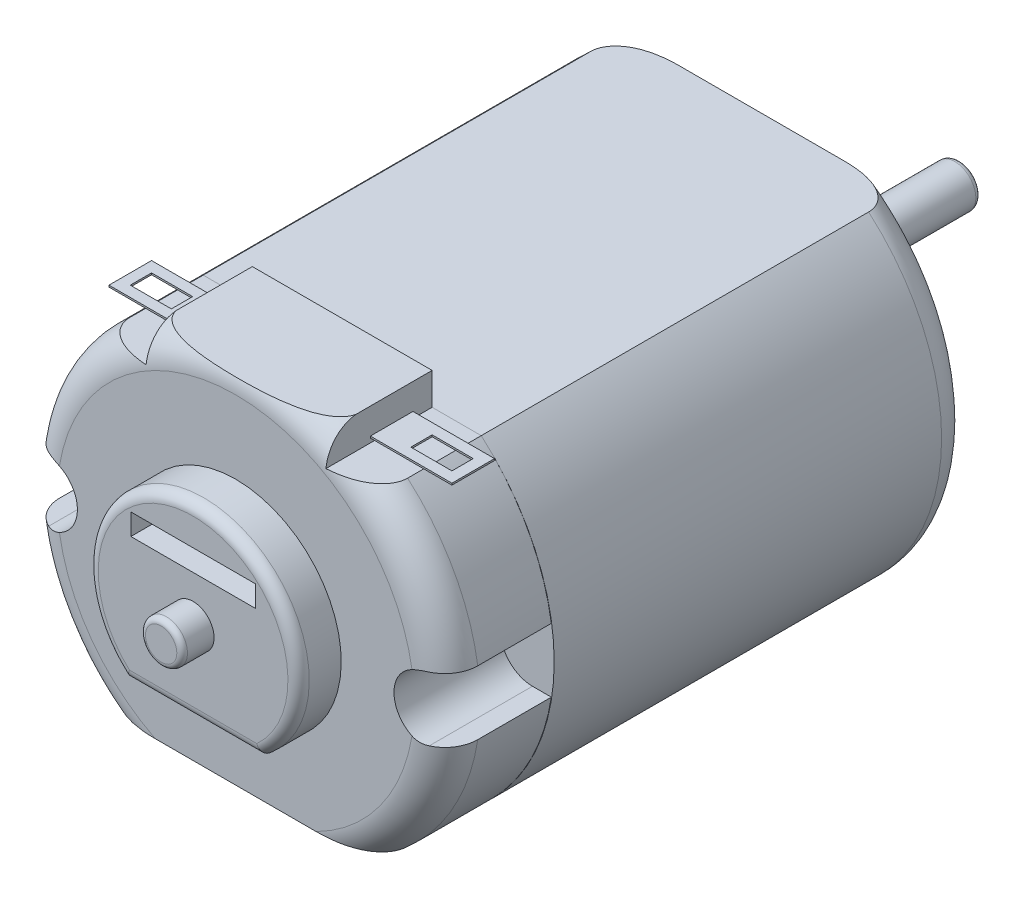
from build123d import *

# Parameters (mm, degrees)
EXTRUDE1_DEPTH          = 5
EXTRUDE2_DEPTH          = 2
SKETCH5_R               = 0.985
EXTRUDE3_DEPTH          = 1.5
FILLET1_R               = 0.25
FILLET2_R               = 0.5
CUT_EXTRUDE2_DEPTH      = 14.402616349
SKETCH7_W               = 8.44
SKETCH7_H               = 5
EXTRUDE4_DEPTH          = 1.5
SKETCH9_W               = 2
SKETCH9_H               = 0.08
EXTRUDE5_DEPTH          = 3.83
CUT_EXTRUDE4_REACH      = 22.029
SKETCH10_W              = 1.93
SKETCH10_H              = 1
SKETCH21_W              = 2
SKETCH21_H              = 0.08
EXTRUDE6_DEPTH          = 3.83
SKETCH22_W              = 1.93
SKETCH22_H              = 1
CUT_EXTRUDE5_DEPTH      = 0.09
EXTRUDE7_DEPTH          = 19.685
FILLET6_R               = 1.5
SKETCH26_R              = 3.048
EXTRUDE9_DEPTH          = 1.6002
SKETCH27_R              = 2.54
CUT_EXTRUDE6_DEPTH      = 0.5334
CHAMFER1_SIZE           = 0.4
CHAMFER1_SIZE2          = 0.145588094
EXTRUDE10_START         = 8.255
SKETCH29_R              = 0.985
EXTRUDE10_DEPTH         = 8.255
FILLET7_R               = 0.25
SKETCH30_R              = 0.73025
CUT_EXTRUDE7_DEPTH      = 8.255
CUT_EXTRUDE9_DEPTH      = 2
CUT_EXTRUDE9_DEPTH_BACK = 5


with BuildPart() as part:
    # Sketch1 → Extrude1 (new body)
    with BuildSketch(Plane.XY):
        with BuildLine():
            Line((-6.525310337, -7.485), (6.525310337, -7.485))
            ThreePointArc((6.525310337, -7.485), (9.93, 0), (6.525310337, 7.485))
            Line((6.525310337, 7.485), (-6.525310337, 7.485))
            ThreePointArc((-6.525310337, 7.485), (-9.93, 0), (-6.525310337, -7.485))
        make_face()
    extrude(amount=EXTRUDE1_DEPTH)

    # Sketch2 → Extrude2 (add)
    with BuildSketch(Plane.XY.offset(5)):
        with BuildLine():
            Line((-3.175, -3.801523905), (3.175, -3.801523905))
            ThreePointArc((3.175, -3.801523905), (0, 4.953), (-3.175, -3.801523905))
        make_face()
    extrude(amount=EXTRUDE2_DEPTH)

    # Sketch5 → Extrude3 (add)
    with BuildSketch(Plane.XY.offset(7)):
        Circle(SKETCH5_R)
    extrude(amount=EXTRUDE3_DEPTH)

    # Fillet1
    fillet1_edges = [part.edges().sort_by_distance(p)[0] for p in [
        (-0.985, 0, 8.5),
    ]]
    fillet(fillet1_edges, radius=FILLET1_R)

    # Fillet2
    fillet2_edges = [part.edges().sort_by_distance(p)[0] for p in [
        (0, 4.953, 7),
        (0, -3.801523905, 7),
    ]]
    fillet(fillet2_edges, radius=FILLET2_R)

    # Sketch6 → Cut-Extrude2 (cut, through all)
    with BuildSketch(Plane.XY.offset(5)):
        with BuildLine():
            Line((8.93, 1.5), (9.816053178, 1.5))
            ThreePointArc((9.816053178, 1.5), (9.93, 0), (9.816053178, -1.5))
            Line((9.816053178, -1.5), (8.93, -1.5))
            ThreePointArc((8.93, -1.5), (7.43, 0), (8.93, 1.5))
        make_face()
    cut_extrude2 = extrude(amount=-CUT_EXTRUDE2_DEPTH, mode=Mode.SUBTRACT)

    # Mirror1: Cut-Extrude2 across plane
    add(cut_extrude2.mirror(Plane(origin=(0, 0, 0), x_dir=(0, 0, 1), z_dir=(1, 0, 0))), mode=Mode.SUBTRACT)

    # Sketch7 → Extrude4 (add)
    with BuildSketch(Plane(origin=(0, 7.485, 0), x_dir=(-1, 0, 0), z_dir=(0, 1, 0))):
        with Locations((0, 2.5)):
            Rectangle(SKETCH7_W, SKETCH7_H)
    extrude(amount=EXTRUDE4_DEPTH)

    # Sketch8 → Cut-Revolve1 (revolve, cut)
    with BuildSketch(Plane(origin=(0, 0, 0), x_dir=(-0.9885249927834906, -0.151057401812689, 0), z_dir=(-0.151057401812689, 0.9885249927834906, 0))):
        with BuildLine():
            Line((9.93, 3.453506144), (12.335658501, 3.453506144))
            Line((12.335658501, 3.453506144), (12.335658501, 5.727879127))
            Line((12.335658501, 5.727879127), (8.383506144, 5.727879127))
            Line((8.383506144, 5.727879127), (8.383506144, 5))
            ThreePointArc((8.383506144, 5), (9.477042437, 4.547042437), (9.93, 3.453506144))
        make_face()
    revolve(axis=Axis((0, 0, 0), (0, 0, 1)), mode=Mode.SUBTRACT)

    # Sketch9 → Extrude5 (add)
    with BuildSketch(Plane(origin=(4.22, 0, 0), x_dir=(0, 0, -1), z_dir=(1, 0, 0))):
        with Locations((-1.9, 7.725)):
            Rectangle(SKETCH9_W, SKETCH9_H)
    extrude(amount=EXTRUDE5_DEPTH)

    # Sketch10 → Cut-Extrude4 (cut, up to next)
    with BuildSketch(Plane(origin=(0, 7.765, 0), x_dir=(-1, 0, 0), z_dir=(0, 1, 0)), mode=Mode.PRIVATE) as cut_extrude4_sk1:
        with Locations((-6.585, 1.9)):
            Rectangle(SKETCH10_W, SKETCH10_H)
    cut_extrude4_tool1 = extrude(cut_extrude4_sk1.sketch, amount=-CUT_EXTRUDE4_REACH, mode=Mode.PRIVATE) & part.part
    add(cut_extrude4_tool1.solids().sort_by_distance((6.585, 7.765, 1.9))[0], mode=Mode.SUBTRACT)

    # Sketch21 → Extrude6 (add)
    with BuildSketch(Plane.ZY.offset(4.22)):
        with Locations((1.9, 7.725)):
            Rectangle(SKETCH21_W, SKETCH21_H)
    extrude(amount=EXTRUDE6_DEPTH)

    # Sketch22 → Cut-Extrude5 (cut)
    with BuildSketch(Plane(origin=(0, 7.765, 0), x_dir=(-1, 0, 0), z_dir=(0, 1, 0))):
        with Locations((6.585, 1.9)):
            Rectangle(SKETCH22_W, SKETCH22_H)
    extrude(amount=-CUT_EXTRUDE5_DEPTH, mode=Mode.SUBTRACT)

    # Sketch4 → Cut-Extrude9 (cut, two sides: drawn at the far end of the back side and taken through both)
    with BuildSketch(Plane.XY.offset(5).offset(-CUT_EXTRUDE9_DEPTH_BACK)):
        Polygon((-2.921, 3.161292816), (2.92099995, 3.16205781), (2.921, 2.16205781), (-2.921, 2.16205781), align=None)
    extrude(amount=CUT_EXTRUDE9_DEPTH + CUT_EXTRUDE9_DEPTH_BACK, mode=Mode.SUBTRACT)


with BuildPart() as body_2:
    # Sketch23 → Extrude7 (new body)
    with BuildSketch(Plane(origin=(0, 0, 0), x_dir=(-1, 0, 0), z_dir=(0, 0, -1))):
        with BuildLine():
            Line((-6.525310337, 7.485), (6.525310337, 7.485))
            ThreePointArc((6.525310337, 7.485), (9.926356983, 0), (6.525310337, -7.485))
            Line((6.525310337, -7.485), (-6.525310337, -7.485))
            ThreePointArc((-6.525310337, -7.485), (-9.950448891, 0), (-6.525310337, 7.485))
        make_face()
    extrude(amount=EXTRUDE7_DEPTH)

    # Fillet6
    fillet6_edges = [body_2.edges().sort_by_distance(p)[0] for p in [
        (9.950448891, 0, -19.685),
        (-9.926356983, 0, -19.685),
    ]]
    fillet(fillet6_edges, radius=FILLET6_R)

    # Sketch26 → Extrude9 (add)
    with BuildSketch(Plane(origin=(0, 0, -19.685), x_dir=(-1, 0, 0), z_dir=(0, 0, -1))):
        with Locations(Location((0, 0, 0), (0, 0, 180))):
            Circle(SKETCH26_R)
    extrude(amount=EXTRUDE9_DEPTH)

    # Sketch27 → Cut-Extrude6 (cut)
    with BuildSketch(Plane(origin=(0, 0, -21.2852), x_dir=(-1, 0, 0), z_dir=(0, 0, -1))):
        Circle(SKETCH27_R)
    extrude(amount=-CUT_EXTRUDE6_DEPTH, mode=Mode.SUBTRACT)

    # Chamfer1
    chamfer1_edges = [body_2.edges().sort_by_distance(p)[0] for p in [
        (-3.048, 0, -21.2852),
    ]]
    chamfer1_side = [body_2.faces().sort_by_distance(p)[0] for p in [
        (-3.048, 0, -20.4851),
    ]]
    chamfer(chamfer1_edges, length=CHAMFER1_SIZE, length2=CHAMFER1_SIZE2, reference=chamfer1_side[0])

    # Sketch29 → Extrude10 (add)
    with BuildSketch(Plane(origin=(0, 0, -20.7518), x_dir=(-1, 0, 0), z_dir=(0, 0, -1)).offset(EXTRUDE10_START)):
        Circle(SKETCH29_R)
    extrude(amount=-EXTRUDE10_DEPTH)

    # Fillet7
    fillet7_edges = [body_2.edges().sort_by_distance(p)[0] for p in [
        (0.985, 0, -29.0068),
    ]]
    fillet(fillet7_edges, radius=FILLET7_R)

    # Sketch30 → Cut-Extrude7 (cut)
    with BuildSketch(Plane(origin=(0, 0, -19.685), x_dir=(-1, 0, 0), z_dir=(0, 0, -1))):
        with Locations((0, -5.199)):
            Circle(SKETCH30_R)
    extrude(amount=-CUT_EXTRUDE7_DEPTH, mode=Mode.SUBTRACT)


solid = Compound([part.part, body_2.part])
